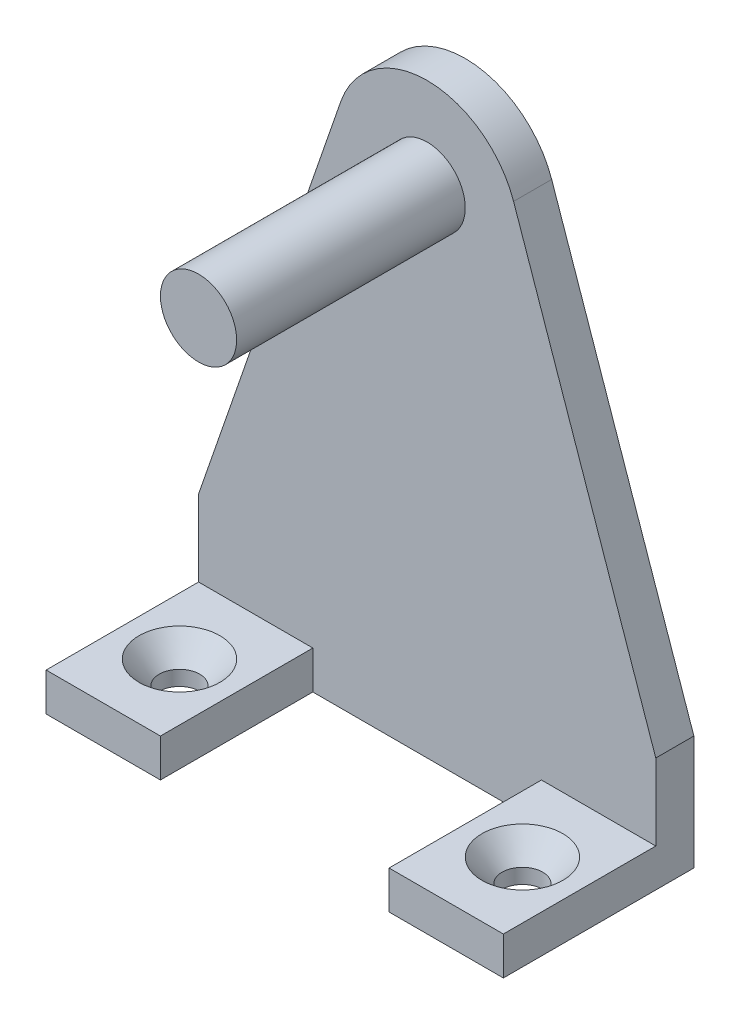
ISO-10303-21;
HEADER;
FILE_DESCRIPTION(('STEP AP214'),'2;1');
FILE_NAME('part.step','',(''),(''),'','','');
FILE_SCHEMA(('AUTOMOTIVE_DESIGN { 1 0 10303 214 1 1 1 1 }'));
ENDSEC;
DATA;
#1=APPLICATION_CONTEXT('core data for automotive mechanical design processes');
#2=APPLICATION_PROTOCOL_DEFINITION('international standard','automotive_design',2000,#1);
#3=PRODUCT_CONTEXT('',#1,'mechanical');
#4=PRODUCT('Part','Part','',(#3));
#5=PRODUCT_RELATED_PRODUCT_CATEGORY('part','',(#4));
#6=PRODUCT_DEFINITION_FORMATION('','',#4);
#7=PRODUCT_DEFINITION_CONTEXT('part definition',#1,'design');
#8=PRODUCT_DEFINITION('design','',#6,#7);
#9=PRODUCT_DEFINITION_SHAPE('','',#8);
#10=(LENGTH_UNIT() NAMED_UNIT(*) SI_UNIT(.MILLI.,.METRE.));
#11=(NAMED_UNIT(*) PLANE_ANGLE_UNIT() SI_UNIT($,.RADIAN.));
#12=(NAMED_UNIT(*) SI_UNIT($,.STERADIAN.) SOLID_ANGLE_UNIT());
#13=UNCERTAINTY_MEASURE_WITH_UNIT(LENGTH_MEASURE(1.E-05),#10,'distance_accuracy_value','');
#14=(GEOMETRIC_REPRESENTATION_CONTEXT(3) GLOBAL_UNCERTAINTY_ASSIGNED_CONTEXT((#13)) GLOBAL_UNIT_ASSIGNED_CONTEXT((#10,
#11,#12)) REPRESENTATION_CONTEXT('',''));
#15=CARTESIAN_POINT('',(0.,0.,0.));
#16=DIRECTION('',(0.,0.,1.));
#17=DIRECTION('',(1.,0.,0.));
#18=AXIS2_PLACEMENT_3D('',#15,#16,#17);
#19=CARTESIAN_POINT('',(-38.1,6.35,25.4));
#20=DIRECTION('',(0.,-1.,0.));
#21=DIRECTION('',(1.,0.,0.));
#22=AXIS2_PLACEMENT_3D('',#19,#20,#21);
#23=PLANE('',#22);
#24=DIRECTION('',(-1.,0.,0.));
#25=VECTOR('',#24,1.);
#26=CARTESIAN_POINT('',(-38.1,6.35,0.));
#27=LINE('',#26,#25);
#28=CARTESIAN_POINT('',(-19.05,6.34999999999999,0.));
#29=VERTEX_POINT('',#28);
#30=CARTESIAN_POINT('',(-38.1,6.34999999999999,0.));
#31=VERTEX_POINT('',#30);
#32=EDGE_CURVE('E183',#29,#31,#27,.T.);
#33=ORIENTED_EDGE('',*,*,#32,.T.);
#34=DIRECTION('',(0.,0.,-1.));
#35=VECTOR('',#34,1.);
#36=CARTESIAN_POINT('',(-38.1,6.35,25.4));
#37=LINE('',#36,#35);
#38=CARTESIAN_POINT('',(-38.1,6.35,25.4));
#39=VERTEX_POINT('',#38);
#40=EDGE_CURVE('E73',#39,#31,#37,.T.);
#41=ORIENTED_EDGE('',*,*,#40,.F.);
#42=DIRECTION('',(-1.,0.,0.));
#43=VECTOR('',#42,1.);
#44=CARTESIAN_POINT('',(-38.1,6.35,25.4));
#45=LINE('',#44,#43);
#46=CARTESIAN_POINT('',(-19.05,6.34999999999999,25.4));
#47=VERTEX_POINT('',#46);
#48=EDGE_CURVE('E187',#47,#39,#45,.T.);
#49=ORIENTED_EDGE('',*,*,#48,.F.);
#50=DIRECTION('',(0.,0.,-1.));
#51=VECTOR('',#50,1.);
#52=CARTESIAN_POINT('',(-19.05,6.34999999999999,25.4));
#53=LINE('',#52,#51);
#54=EDGE_CURVE('E192',#47,#29,#53,.T.);
#55=ORIENTED_EDGE('',*,*,#54,.T.);
#56=EDGE_LOOP('',(#33,#41,#49,#55));
#57=FACE_BOUND('',#56,.T.);
#58=CARTESIAN_POINT('',(-28.575,6.34999999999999,12.7));
#59=DIRECTION('',(0.,1.,0.));
#60=DIRECTION('',(0.,0.,1.));
#61=AXIS2_PLACEMENT_3D('',#58,#59,#60);
#62=CIRCLE('',#61,6.7437);
#63=CARTESIAN_POINT('',(-28.575,6.34999999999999,19.4437));
#64=VERTEX_POINT('',#63);
#65=EDGE_CURVE('E320',#64,#64,#62,.T.);
#66=ORIENTED_EDGE('',*,*,#65,.F.);
#67=EDGE_LOOP('',(#66));
#68=FACE_BOUND('',#67,.T.);
#69=ADVANCED_FACE('F48',(#57,#68),#23,.F.);
#70=CARTESIAN_POINT('',(38.1,6.35000000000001,25.4));
#71=DIRECTION('',(0.,-1.,0.));
#72=DIRECTION('',(1.,0.,0.));
#73=AXIS2_PLACEMENT_3D('',#70,#71,#72);
#74=PLANE('',#73);
#75=DIRECTION('',(-1.,0.,0.));
#76=VECTOR('',#75,1.);
#77=CARTESIAN_POINT('',(38.1,6.35000000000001,0.));
#78=LINE('',#77,#76);
#79=CARTESIAN_POINT('',(38.1,6.35000000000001,0.));
#80=VERTEX_POINT('',#79);
#81=CARTESIAN_POINT('',(19.05,6.35,0.));
#82=VERTEX_POINT('',#81);
#83=EDGE_CURVE('E164',#80,#82,#78,.T.);
#84=ORIENTED_EDGE('',*,*,#83,.T.);
#85=DIRECTION('',(0.,0.,-1.));
#86=VECTOR('',#85,1.);
#87=CARTESIAN_POINT('',(19.05,6.35,25.4));
#88=LINE('',#87,#86);
#89=CARTESIAN_POINT('',(19.05,6.35,25.4));
#90=VERTEX_POINT('',#89);
#91=EDGE_CURVE('E174',#90,#82,#88,.T.);
#92=ORIENTED_EDGE('',*,*,#91,.F.);
#93=DIRECTION('',(-1.,0.,0.));
#94=VECTOR('',#93,1.);
#95=CARTESIAN_POINT('',(38.1,6.35000000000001,25.4));
#96=LINE('',#95,#94);
#97=CARTESIAN_POINT('',(38.1,6.35000000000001,25.4));
#98=VERTEX_POINT('',#97);
#99=EDGE_CURVE('E157',#98,#90,#96,.T.);
#100=ORIENTED_EDGE('',*,*,#99,.F.);
#101=DIRECTION('',(0.,0.,-1.));
#102=VECTOR('',#101,1.);
#103=CARTESIAN_POINT('',(38.1,6.35000000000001,25.4));
#104=LINE('',#103,#102);
#105=EDGE_CURVE('E154',#98,#80,#104,.T.);
#106=ORIENTED_EDGE('',*,*,#105,.T.);
#107=EDGE_LOOP('',(#84,#92,#100,#106));
#108=FACE_BOUND('',#107,.T.);
#109=CARTESIAN_POINT('',(28.575,6.34999999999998,12.7));
#110=DIRECTION('',(0.,1.,0.));
#111=DIRECTION('',(0.,0.,1.));
#112=AXIS2_PLACEMENT_3D('',#109,#110,#111);
#113=CIRCLE('',#112,6.7437);
#114=CARTESIAN_POINT('',(28.575,6.34999999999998,19.4437));
#115=VERTEX_POINT('',#114);
#116=EDGE_CURVE('E310',#115,#115,#113,.T.);
#117=ORIENTED_EDGE('',*,*,#116,.F.);
#118=EDGE_LOOP('',(#117));
#119=FACE_BOUND('',#118,.T.);
#120=ADVANCED_FACE('F267',(#108,#119),#74,.F.);
#121=CARTESIAN_POINT('',(0.,-48.3537648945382,0.));
#122=DIRECTION('',(0.,0.,1.));
#123=DIRECTION('',(1.,0.,0.));
#124=AXIS2_PLACEMENT_3D('',#121,#122,#123);
#125=PLANE('',#124);
#126=CARTESIAN_POINT('',(0.,82.55,0.));
#127=DIRECTION('',(0.,0.,1.));
#128=DIRECTION('',(1.,0.,0.));
#129=AXIS2_PLACEMENT_3D('',#126,#127,#128);
#130=CIRCLE('',#129,6.35);
#131=CARTESIAN_POINT('',(-6.35,82.55,0.));
#132=VERTEX_POINT('',#131);
#133=EDGE_CURVE('E198',#132,#132,#130,.T.);
#134=ORIENTED_EDGE('',*,*,#133,.F.);
#135=EDGE_LOOP('',(#134));
#136=FACE_BOUND('',#135,.T.);
#137=DIRECTION('',(0.,-1.,0.));
#138=VECTOR('',#137,1.);
#139=CARTESIAN_POINT('',(19.05,0.,0.));
#140=LINE('',#139,#138);
#141=CARTESIAN_POINT('',(19.05,0.,0.));
#142=VERTEX_POINT('',#141);
#143=EDGE_CURVE('E162',#82,#142,#140,.T.);
#144=ORIENTED_EDGE('',*,*,#143,.F.);
#145=ORIENTED_EDGE('',*,*,#83,.F.);
#146=DIRECTION('',(0.,1.,0.));
#147=VECTOR('',#146,1.);
#148=CARTESIAN_POINT('',(38.1,-48.3537648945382,0.));
#149=LINE('',#148,#147);
#150=CARTESIAN_POINT('',(38.1,19.05,0.));
#151=VERTEX_POINT('',#150);
#152=EDGE_CURVE('E226',#80,#151,#149,.T.);
#153=ORIENTED_EDGE('',*,*,#152,.T.);
#154=DIRECTION('',(-0.327012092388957,0.945020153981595,0.));
#155=VECTOR('',#154,1.);
#156=CARTESIAN_POINT('',(54.8556926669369,-29.3716566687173,0.));
#157=LINE('',#156,#155);
#158=CARTESIAN_POINT('',(14.4021071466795,87.5336642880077,0.));
#159=VERTEX_POINT('',#158);
#160=EDGE_CURVE('E208',#151,#159,#157,.T.);
#161=ORIENTED_EDGE('',*,*,#160,.T.);
#162=CARTESIAN_POINT('',(0.,82.55,0.));
#163=DIRECTION('',(0.,0.,1.));
#164=DIRECTION('',(1.,0.,0.));
#165=AXIS2_PLACEMENT_3D('',#162,#163,#164);
#166=CIRCLE('',#165,15.24);
#167=CARTESIAN_POINT('',(-14.4021071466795,87.5336642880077,0.));
#168=VERTEX_POINT('',#167);
#169=EDGE_CURVE('E202',#168,#159,#166,.F.);
#170=ORIENTED_EDGE('',*,*,#169,.F.);
#171=DIRECTION('',(0.327012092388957,0.945020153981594,0.));
#172=VECTOR('',#171,1.);
#173=CARTESIAN_POINT('',(-54.8556926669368,-29.3716566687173,0.));
#174=LINE('',#173,#172);
#175=CARTESIAN_POINT('',(-38.1,19.05,0.));
#176=VERTEX_POINT('',#175);
#177=EDGE_CURVE('E220',#176,#168,#174,.T.);
#178=ORIENTED_EDGE('',*,*,#177,.F.);
#179=DIRECTION('',(0.,1.,0.));
#180=VECTOR('',#179,1.);
#181=CARTESIAN_POINT('',(-38.1,-48.3537648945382,0.));
#182=LINE('',#181,#180);
#183=EDGE_CURVE('E222',#31,#176,#182,.T.);
#184=ORIENTED_EDGE('',*,*,#183,.F.);
#185=ORIENTED_EDGE('',*,*,#32,.F.);
#186=DIRECTION('',(0.,1.,0.));
#187=VECTOR('',#186,1.);
#188=CARTESIAN_POINT('',(-19.05,0.,0.));
#189=LINE('',#188,#187);
#190=CARTESIAN_POINT('',(-19.05,0.,0.));
#191=VERTEX_POINT('',#190);
#192=EDGE_CURVE('E178',#191,#29,#189,.T.);
#193=ORIENTED_EDGE('',*,*,#192,.F.);
#194=DIRECTION('',(-1.,0.,0.));
#195=VECTOR('',#194,1.);
#196=CARTESIAN_POINT('',(0.,0.,0.));
#197=LINE('',#196,#195);
#198=EDGE_CURVE('E224',#142,#191,#197,.T.);
#199=ORIENTED_EDGE('',*,*,#198,.F.);
#200=EDGE_LOOP('',(#144,#145,#153,#161,#170,#178,#184,#185,#193,#199));
#201=FACE_BOUND('',#200,.T.);
#202=ADVANCED_FACE('F246',(#136,#201),#125,.T.);
#203=CARTESIAN_POINT('',(0.,82.55,-6.35));
#204=DIRECTION('',(0.,0.,1.));
#205=DIRECTION('',(1.,0.,0.));
#206=AXIS2_PLACEMENT_3D('',#203,#204,#205);
#207=CYLINDRICAL_SURFACE('',#206,15.24);
#208=ORIENTED_EDGE('',*,*,#169,.T.);
#209=DIRECTION('',(0.,0.,1.));
#210=VECTOR('',#209,1.);
#211=CARTESIAN_POINT('',(14.4021071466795,87.5336642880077,-6.35));
#212=LINE('',#211,#210);
#213=CARTESIAN_POINT('',(14.4021071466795,87.5336642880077,-6.35));
#214=VERTEX_POINT('',#213);
#215=EDGE_CURVE('E12',#214,#159,#212,.T.);
#216=ORIENTED_EDGE('',*,*,#215,.F.);
#217=CARTESIAN_POINT('',(0.,82.55,-6.35));
#218=DIRECTION('',(0.,0.,1.));
#219=DIRECTION('',(1.,0.,0.));
#220=AXIS2_PLACEMENT_3D('',#217,#218,#219);
#221=CIRCLE('',#220,15.24);
#222=CARTESIAN_POINT('',(-14.4021071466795,87.5336642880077,-6.35));
#223=VERTEX_POINT('',#222);
#224=EDGE_CURVE('E205',#223,#214,#221,.F.);
#225=ORIENTED_EDGE('',*,*,#224,.F.);
#226=DIRECTION('',(0.,0.,1.));
#227=VECTOR('',#226,1.);
#228=CARTESIAN_POINT('',(-14.4021071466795,87.5336642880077,-6.35));
#229=LINE('',#228,#227);
#230=EDGE_CURVE('E52',#223,#168,#229,.T.);
#231=ORIENTED_EDGE('',*,*,#230,.T.);
#232=EDGE_LOOP('',(#208,#216,#225,#231));
#233=FACE_BOUND('',#232,.T.);
#234=ADVANCED_FACE('F50',(#233),#207,.T.);
#235=CARTESIAN_POINT('',(54.8556926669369,-29.3716566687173,-6.35));
#236=DIRECTION('',(0.945020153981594,0.327012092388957,0.));
#237=DIRECTION('',(-0.327012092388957,0.945020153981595,0.));
#238=AXIS2_PLACEMENT_3D('',#235,#236,#237);
#239=PLANE('',#238);
#240=ORIENTED_EDGE('',*,*,#160,.F.);
#241=DIRECTION('',(0.,0.,1.));
#242=VECTOR('',#241,1.);
#243=CARTESIAN_POINT('',(38.1,19.05,-6.35));
#244=LINE('',#243,#242);
#245=CARTESIAN_POINT('',(38.1,19.05,-6.35));
#246=VERTEX_POINT('',#245);
#247=EDGE_CURVE('E57',#246,#151,#244,.T.);
#248=ORIENTED_EDGE('',*,*,#247,.F.);
#249=DIRECTION('',(-0.327012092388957,0.945020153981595,0.));
#250=VECTOR('',#249,1.);
#251=CARTESIAN_POINT('',(54.8556926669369,-29.3716566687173,-6.35));
#252=LINE('',#251,#250);
#253=EDGE_CURVE('E215',#246,#214,#252,.T.);
#254=ORIENTED_EDGE('',*,*,#253,.T.);
#255=ORIENTED_EDGE('',*,*,#215,.T.);
#256=EDGE_LOOP('',(#240,#248,#254,#255));
#257=FACE_BOUND('',#256,.T.);
#258=ADVANCED_FACE('F251',(#257),#239,.T.);
#259=CARTESIAN_POINT('',(38.1,-48.3537648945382,-6.35));
#260=DIRECTION('',(1.,0.,0.));
#261=DIRECTION('',(0.,0.,-1.));
#262=AXIS2_PLACEMENT_3D('',#259,#260,#261);
#263=PLANE('',#262);
#264=ORIENTED_EDGE('',*,*,#152,.F.);
#265=ORIENTED_EDGE('',*,*,#105,.F.);
#266=DIRECTION('',(0.,1.,0.));
#267=VECTOR('',#266,1.);
#268=CARTESIAN_POINT('',(38.1,0.,25.4));
#269=LINE('',#268,#267);
#270=CARTESIAN_POINT('',(38.1,0.,25.4));
#271=VERTEX_POINT('',#270);
#272=EDGE_CURVE('E151',#271,#98,#269,.T.);
#273=ORIENTED_EDGE('',*,*,#272,.F.);
#274=DIRECTION('',(0.,0.,1.));
#275=VECTOR('',#274,1.);
#276=CARTESIAN_POINT('',(38.1,0.,-6.35));
#277=LINE('',#276,#275);
#278=CARTESIAN_POINT('',(38.1,0.,-6.35));
#279=VERTEX_POINT('',#278);
#280=EDGE_CURVE('E138',#279,#271,#277,.T.);
#281=ORIENTED_EDGE('',*,*,#280,.F.);
#282=DIRECTION('',(0.,1.,0.));
#283=VECTOR('',#282,1.);
#284=CARTESIAN_POINT('',(38.1,-48.3537648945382,-6.35));
#285=LINE('',#284,#283);
#286=EDGE_CURVE('E213',#279,#246,#285,.T.);
#287=ORIENTED_EDGE('',*,*,#286,.T.);
#288=ORIENTED_EDGE('',*,*,#247,.T.);
#289=EDGE_LOOP('',(#264,#265,#273,#281,#287,#288));
#290=FACE_BOUND('',#289,.T.);
#291=ADVANCED_FACE('F153',(#290),#263,.T.);
#292=CARTESIAN_POINT('',(0.,0.,-6.35));
#293=DIRECTION('',(0.,1.,0.));
#294=DIRECTION('',(-1.,0.,0.));
#295=AXIS2_PLACEMENT_3D('',#292,#293,#294);
#296=PLANE('',#295);
#297=CARTESIAN_POINT('',(-28.575,0.,12.7));
#298=DIRECTION('',(0.,1.,0.));
#299=DIRECTION('',(0.,0.,1.));
#300=AXIS2_PLACEMENT_3D('',#297,#298,#299);
#301=CIRCLE('',#300,3.3782);
#302=CARTESIAN_POINT('',(-28.575,0.,16.0782));
#303=VERTEX_POINT('',#302);
#304=EDGE_CURVE('E304',#303,#303,#301,.T.);
#305=ORIENTED_EDGE('',*,*,#304,.T.);
#306=EDGE_LOOP('',(#305));
#307=FACE_BOUND('',#306,.T.);
#308=CARTESIAN_POINT('',(28.575,0.,12.7));
#309=DIRECTION('',(0.,1.,0.));
#310=DIRECTION('',(0.,0.,1.));
#311=AXIS2_PLACEMENT_3D('',#308,#309,#310);
#312=CIRCLE('',#311,3.3782);
#313=CARTESIAN_POINT('',(28.575,0.,16.0782));
#314=VERTEX_POINT('',#313);
#315=EDGE_CURVE('E167',#314,#314,#312,.T.);
#316=ORIENTED_EDGE('',*,*,#315,.T.);
#317=EDGE_LOOP('',(#316));
#318=FACE_BOUND('',#317,.T.);
#319=ORIENTED_EDGE('',*,*,#280,.T.);
#320=DIRECTION('',(1.,0.,0.));
#321=VECTOR('',#320,1.);
#322=CARTESIAN_POINT('',(38.1,0.,25.4));
#323=LINE('',#322,#321);
#324=CARTESIAN_POINT('',(19.05,0.,25.4));
#325=VERTEX_POINT('',#324);
#326=EDGE_CURVE('E142',#325,#271,#323,.T.);
#327=ORIENTED_EDGE('',*,*,#326,.F.);
#328=DIRECTION('',(0.,0.,-1.));
#329=VECTOR('',#328,1.);
#330=CARTESIAN_POINT('',(19.05,0.,25.4));
#331=LINE('',#330,#329);
#332=EDGE_CURVE('E65',#325,#142,#331,.T.);
#333=ORIENTED_EDGE('',*,*,#332,.T.);
#334=ORIENTED_EDGE('',*,*,#198,.T.);
#335=DIRECTION('',(0.,0.,-1.));
#336=VECTOR('',#335,1.);
#337=CARTESIAN_POINT('',(-19.05,0.,25.4));
#338=LINE('',#337,#336);
#339=CARTESIAN_POINT('',(-19.05,0.,25.4));
#340=VERTEX_POINT('',#339);
#341=EDGE_CURVE('E195',#340,#191,#338,.T.);
#342=ORIENTED_EDGE('',*,*,#341,.F.);
#343=DIRECTION('',(1.,0.,0.));
#344=VECTOR('',#343,1.);
#345=CARTESIAN_POINT('',(-38.1,0.,25.4));
#346=LINE('',#345,#344);
#347=CARTESIAN_POINT('',(-38.1,0.,25.4));
#348=VERTEX_POINT('',#347);
#349=EDGE_CURVE('E182',#348,#340,#346,.T.);
#350=ORIENTED_EDGE('',*,*,#349,.F.);
#351=DIRECTION('',(0.,0.,1.));
#352=VECTOR('',#351,1.);
#353=CARTESIAN_POINT('',(-38.1,0.,-6.35));
#354=LINE('',#353,#352);
#355=CARTESIAN_POINT('',(-38.1,0.,-6.35));
#356=VERTEX_POINT('',#355);
#357=EDGE_CURVE('E148',#356,#348,#354,.T.);
#358=ORIENTED_EDGE('',*,*,#357,.F.);
#359=DIRECTION('',(-1.,0.,0.));
#360=VECTOR('',#359,1.);
#361=CARTESIAN_POINT('',(0.,0.,-6.35));
#362=LINE('',#361,#360);
#363=EDGE_CURVE('E144',#279,#356,#362,.T.);
#364=ORIENTED_EDGE('',*,*,#363,.F.);
#365=EDGE_LOOP('',(#319,#327,#333,#334,#342,#350,#358,#364));
#366=FACE_BOUND('',#365,.T.);
#367=ADVANCED_FACE('F140',(#307,#318,#366),#296,.F.);
#368=CARTESIAN_POINT('',(-38.1,-48.3537648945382,-6.35));
#369=DIRECTION('',(1.,0.,0.));
#370=DIRECTION('',(0.,0.,-1.));
#371=AXIS2_PLACEMENT_3D('',#368,#369,#370);
#372=PLANE('',#371);
#373=ORIENTED_EDGE('',*,*,#357,.T.);
#374=DIRECTION('',(0.,-1.,0.));
#375=VECTOR('',#374,1.);
#376=CARTESIAN_POINT('',(-38.1,0.,25.4));
#377=LINE('',#376,#375);
#378=EDGE_CURVE('E179',#39,#348,#377,.T.);
#379=ORIENTED_EDGE('',*,*,#378,.F.);
#380=ORIENTED_EDGE('',*,*,#40,.T.);
#381=ORIENTED_EDGE('',*,*,#183,.T.);
#382=DIRECTION('',(0.,0.,1.));
#383=VECTOR('',#382,1.);
#384=CARTESIAN_POINT('',(-38.1,19.05,-6.35));
#385=LINE('',#384,#383);
#386=CARTESIAN_POINT('',(-38.1,19.05,-6.35));
#387=VERTEX_POINT('',#386);
#388=EDGE_CURVE('E232',#387,#176,#385,.T.);
#389=ORIENTED_EDGE('',*,*,#388,.F.);
#390=DIRECTION('',(0.,1.,0.));
#391=VECTOR('',#390,1.);
#392=CARTESIAN_POINT('',(-38.1,-48.3537648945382,-6.35));
#393=LINE('',#392,#391);
#394=EDGE_CURVE('E210',#356,#387,#393,.T.);
#395=ORIENTED_EDGE('',*,*,#394,.F.);
#396=EDGE_LOOP('',(#373,#379,#380,#381,#389,#395));
#397=FACE_BOUND('',#396,.T.);
#398=ADVANCED_FACE('F258',(#397),#372,.F.);
#399=CARTESIAN_POINT('',(-54.8556926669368,-29.3716566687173,-6.35));
#400=DIRECTION('',(0.945020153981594,-0.327012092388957,0.));
#401=DIRECTION('',(0.327012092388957,0.945020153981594,0.));
#402=AXIS2_PLACEMENT_3D('',#399,#400,#401);
#403=PLANE('',#402);
#404=ORIENTED_EDGE('',*,*,#177,.T.);
#405=ORIENTED_EDGE('',*,*,#230,.F.);
#406=DIRECTION('',(0.327012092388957,0.945020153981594,0.));
#407=VECTOR('',#406,1.);
#408=CARTESIAN_POINT('',(-54.8556926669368,-29.3716566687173,-6.35));
#409=LINE('',#408,#407);
#410=EDGE_CURVE('E207',#387,#223,#409,.T.);
#411=ORIENTED_EDGE('',*,*,#410,.F.);
#412=ORIENTED_EDGE('',*,*,#388,.T.);
#413=EDGE_LOOP('',(#404,#405,#411,#412));
#414=FACE_BOUND('',#413,.T.);
#415=ADVANCED_FACE('F256',(#414),#403,.F.);
#416=CARTESIAN_POINT('',(0.,-48.3537648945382,-6.35));
#417=DIRECTION('',(0.,0.,1.));
#418=DIRECTION('',(1.,0.,0.));
#419=AXIS2_PLACEMENT_3D('',#416,#417,#418);
#420=PLANE('',#419);
#421=ORIENTED_EDGE('',*,*,#224,.T.);
#422=ORIENTED_EDGE('',*,*,#253,.F.);
#423=ORIENTED_EDGE('',*,*,#286,.F.);
#424=ORIENTED_EDGE('',*,*,#363,.T.);
#425=ORIENTED_EDGE('',*,*,#394,.T.);
#426=ORIENTED_EDGE('',*,*,#410,.T.);
#427=EDGE_LOOP('',(#421,#422,#423,#424,#425,#426));
#428=FACE_BOUND('',#427,.T.);
#429=ADVANCED_FACE('F254',(#428),#420,.F.);
#430=CARTESIAN_POINT('',(0.,82.55,38.1));
#431=DIRECTION('',(0.,0.,-1.));
#432=DIRECTION('',(-1.,0.,0.));
#433=AXIS2_PLACEMENT_3D('',#430,#431,#432);
#434=CYLINDRICAL_SURFACE('',#433,6.35);
#435=CARTESIAN_POINT('',(0.,82.55,38.1));
#436=DIRECTION('',(0.,0.,1.));
#437=DIRECTION('',(1.,0.,0.));
#438=AXIS2_PLACEMENT_3D('',#435,#436,#437);
#439=CIRCLE('',#438,6.35);
#440=CARTESIAN_POINT('',(-6.35,82.55,38.1));
#441=VERTEX_POINT('',#440);
#442=EDGE_CURVE('E199',#441,#441,#439,.T.);
#443=CARTESIAN_POINT('',(-6.35,82.55,0.));
#444=CARTESIAN_POINT('',(-6.35,82.55,0.396875));
#445=CARTESIAN_POINT('',(-6.35,82.55,0.79375));
#446=CARTESIAN_POINT('',(-6.35,82.55,1.5875));
#447=CARTESIAN_POINT('',(-6.35,82.55,1.984375));
#448=CARTESIAN_POINT('',(-6.35,82.55,2.778125));
#449=CARTESIAN_POINT('',(-6.35,82.55,3.175));
#450=CARTESIAN_POINT('',(-6.35,82.55,3.96875));
#451=CARTESIAN_POINT('',(-6.35,82.55,4.365625));
#452=CARTESIAN_POINT('',(-6.35,82.55,5.159375));
#453=CARTESIAN_POINT('',(-6.35,82.55,5.55625));
#454=CARTESIAN_POINT('',(-6.35,82.55,6.35));
#455=CARTESIAN_POINT('',(-6.35,82.55,6.746875));
#456=CARTESIAN_POINT('',(-6.35,82.55,7.540625));
#457=CARTESIAN_POINT('',(-6.35,82.55,7.93749999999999));
#458=CARTESIAN_POINT('',(-6.35,82.55,8.73124999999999));
#459=CARTESIAN_POINT('',(-6.35,82.55,9.128125));
#460=CARTESIAN_POINT('',(-6.35,82.55,9.92187499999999));
#461=CARTESIAN_POINT('',(-6.35,82.55,10.31875));
#462=CARTESIAN_POINT('',(-6.35,82.55,11.1125));
#463=CARTESIAN_POINT('',(-6.35,82.55,11.509375));
#464=CARTESIAN_POINT('',(-6.35,82.55,12.303125));
#465=CARTESIAN_POINT('',(-6.35,82.55,12.7));
#466=CARTESIAN_POINT('',(-6.35,82.55,13.49375));
#467=CARTESIAN_POINT('',(-6.35,82.55,13.890625));
#468=CARTESIAN_POINT('',(-6.35,82.55,14.684375));
#469=CARTESIAN_POINT('',(-6.35,82.55,15.08125));
#470=CARTESIAN_POINT('',(-6.35,82.55,15.875));
#471=CARTESIAN_POINT('',(-6.35,82.55,16.271875));
#472=CARTESIAN_POINT('',(-6.35,82.55,17.065625));
#473=CARTESIAN_POINT('',(-6.35,82.55,17.4625));
#474=CARTESIAN_POINT('',(-6.35,82.55,18.25625));
#475=CARTESIAN_POINT('',(-6.35,82.55,18.653125));
#476=CARTESIAN_POINT('',(-6.35,82.55,19.446875));
#477=CARTESIAN_POINT('',(-6.35,82.55,19.84375));
#478=CARTESIAN_POINT('',(-6.35,82.55,20.6375));
#479=CARTESIAN_POINT('',(-6.35,82.55,21.034375));
#480=CARTESIAN_POINT('',(-6.35,82.55,21.828125));
#481=CARTESIAN_POINT('',(-6.35,82.55,22.225));
#482=CARTESIAN_POINT('',(-6.35,82.55,23.01875));
#483=CARTESIAN_POINT('',(-6.35,82.55,23.415625));
#484=CARTESIAN_POINT('',(-6.35,82.55,24.209375));
#485=CARTESIAN_POINT('',(-6.35,82.55,24.60625));
#486=CARTESIAN_POINT('',(-6.35,82.55,25.4));
#487=CARTESIAN_POINT('',(-6.35,82.55,25.796875));
#488=CARTESIAN_POINT('',(-6.35,82.55,26.590625));
#489=CARTESIAN_POINT('',(-6.35,82.55,26.9875));
#490=CARTESIAN_POINT('',(-6.35,82.55,27.78125));
#491=CARTESIAN_POINT('',(-6.35,82.55,28.178125));
#492=CARTESIAN_POINT('',(-6.35,82.55,28.971875));
#493=CARTESIAN_POINT('',(-6.35,82.55,29.36875));
#494=CARTESIAN_POINT('',(-6.35,82.55,30.1625));
#495=CARTESIAN_POINT('',(-6.35,82.55,30.559375));
#496=CARTESIAN_POINT('',(-6.35,82.55,31.353125));
#497=CARTESIAN_POINT('',(-6.35,82.55,31.75));
#498=CARTESIAN_POINT('',(-6.35,82.55,32.54375));
#499=CARTESIAN_POINT('',(-6.35,82.55,32.940625));
#500=CARTESIAN_POINT('',(-6.35,82.55,33.734375));
#501=CARTESIAN_POINT('',(-6.35,82.55,34.13125));
#502=CARTESIAN_POINT('',(-6.35,82.55,34.925));
#503=CARTESIAN_POINT('',(-6.35,82.55,35.321875));
#504=CARTESIAN_POINT('',(-6.35,82.55,36.115625));
#505=CARTESIAN_POINT('',(-6.35,82.55,36.5125));
#506=CARTESIAN_POINT('',(-6.35,82.55,37.30625));
#507=CARTESIAN_POINT('',(-6.35,82.55,37.703125));
#508=CARTESIAN_POINT('',(-6.35,82.55,38.1));
#509=B_SPLINE_CURVE_WITH_KNOTS('',3,(#443,#444,#445,#446,#447,#448,#449,#450,#451,#452,#453,
#454,#455,#456,#457,#458,#459,#460,#461,#462,#463,#464,#465,#466,#467,#468,#469,#470,#471,#472,
#473,#474,#475,#476,#477,#478,#479,#480,#481,#482,#483,#484,#485,#486,#487,#488,#489,#490,#491,
#492,#493,#494,#495,#496,#497,#498,#499,#500,#501,#502,#503,#504,#505,#506,#507,#508),
.UNSPECIFIED.,.F.,.F.,(4,2,2,2,2,2,2,2,2,2,2,2,2,2,2,2,2,2,2,2,2,2,2,2,2,2,2,2,2,2,2,2,4),(0.,
1.190625,2.38125,3.571875,4.7625,5.953125,7.14375,8.33437499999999,9.525,10.715625,11.90625,
13.096875,14.2875,15.478125,16.66875,17.859375,19.05,20.240625,21.43125,22.621875,23.8125,
25.003125,26.19375,27.384375,28.575,29.765625,30.95625,32.146875,33.3375,34.528125,35.71875,
36.909375,38.1),.UNSPECIFIED.);
#510=EDGE_CURVE('BSEAM263',#132,#441,#509,.T.);
#511=ORIENTED_EDGE('',*,*,#133,.T.);
#512=ORIENTED_EDGE('',*,*,#442,.F.);
#513=ORIENTED_EDGE('',*,*,#510,.T.);
#514=ORIENTED_EDGE('',*,*,#510,.F.);
#515=EDGE_LOOP('',(#511,#513,#512,#514));
#516=FACE_BOUND('',#515,.T.);
#517=ADVANCED_FACE('F263',(#516),#434,.T.);
#518=CARTESIAN_POINT('',(0.,-48.3537648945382,38.1));
#519=DIRECTION('',(0.,0.,1.));
#520=DIRECTION('',(1.,0.,0.));
#521=AXIS2_PLACEMENT_3D('',#518,#519,#520);
#522=PLANE('',#521);
#523=ORIENTED_EDGE('',*,*,#442,.T.);
#524=EDGE_LOOP('',(#523));
#525=FACE_BOUND('',#524,.T.);
#526=ADVANCED_FACE('F282',(#525),#522,.T.);
#527=CARTESIAN_POINT('',(-19.05,0.,25.4));
#528=DIRECTION('',(-1.,0.,0.));
#529=DIRECTION('',(0.,0.,1.));
#530=AXIS2_PLACEMENT_3D('',#527,#528,#529);
#531=PLANE('',#530);
#532=ORIENTED_EDGE('',*,*,#192,.T.);
#533=ORIENTED_EDGE('',*,*,#54,.F.);
#534=DIRECTION('',(0.,1.,0.));
#535=VECTOR('',#534,1.);
#536=CARTESIAN_POINT('',(-19.05,0.,25.4));
#537=LINE('',#536,#535);
#538=EDGE_CURVE('E185',#340,#47,#537,.T.);
#539=ORIENTED_EDGE('',*,*,#538,.F.);
#540=ORIENTED_EDGE('',*,*,#341,.T.);
#541=EDGE_LOOP('',(#532,#533,#539,#540));
#542=FACE_BOUND('',#541,.T.);
#543=ADVANCED_FACE('F279',(#542),#531,.F.);
#544=CARTESIAN_POINT('',(-38.1,6.35,25.4));
#545=DIRECTION('',(0.,0.,-1.));
#546=DIRECTION('',(-1.,0.,0.));
#547=AXIS2_PLACEMENT_3D('',#544,#545,#546);
#548=PLANE('',#547);
#549=ORIENTED_EDGE('',*,*,#378,.T.);
#550=ORIENTED_EDGE('',*,*,#349,.T.);
#551=ORIENTED_EDGE('',*,*,#538,.T.);
#552=ORIENTED_EDGE('',*,*,#48,.T.);
#553=EDGE_LOOP('',(#549,#550,#551,#552));
#554=FACE_BOUND('',#553,.T.);
#555=ADVANCED_FACE('F278',(#554),#548,.F.);
#556=CARTESIAN_POINT('',(19.05,0.,25.4));
#557=DIRECTION('',(1.,0.,0.));
#558=DIRECTION('',(0.,0.,-1.));
#559=AXIS2_PLACEMENT_3D('',#556,#557,#558);
#560=PLANE('',#559);
#561=ORIENTED_EDGE('',*,*,#143,.T.);
#562=ORIENTED_EDGE('',*,*,#332,.F.);
#563=DIRECTION('',(0.,-1.,0.));
#564=VECTOR('',#563,1.);
#565=CARTESIAN_POINT('',(19.05,0.,25.4));
#566=LINE('',#565,#564);
#567=EDGE_CURVE('E161',#90,#325,#566,.T.);
#568=ORIENTED_EDGE('',*,*,#567,.F.);
#569=ORIENTED_EDGE('',*,*,#91,.T.);
#570=EDGE_LOOP('',(#561,#562,#568,#569));
#571=FACE_BOUND('',#570,.T.);
#572=ADVANCED_FACE('F345',(#571),#560,.F.);
#573=CARTESIAN_POINT('',(19.05,0.,25.4));
#574=DIRECTION('',(0.,0.,-1.));
#575=DIRECTION('',(-1.,0.,0.));
#576=AXIS2_PLACEMENT_3D('',#573,#574,#575);
#577=PLANE('',#576);
#578=ORIENTED_EDGE('',*,*,#326,.T.);
#579=ORIENTED_EDGE('',*,*,#272,.T.);
#580=ORIENTED_EDGE('',*,*,#99,.T.);
#581=ORIENTED_EDGE('',*,*,#567,.T.);
#582=EDGE_LOOP('',(#578,#579,#580,#581));
#583=FACE_BOUND('',#582,.T.);
#584=ADVANCED_FACE('F159',(#583),#577,.F.);
#585=CARTESIAN_POINT('',(28.575,6.34999999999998,12.7));
#586=DIRECTION('',(0.,1.,0.));
#587=DIRECTION('',(0.,0.,1.));
#588=AXIS2_PLACEMENT_3D('',#585,#586,#587);
#589=CYLINDRICAL_SURFACE('',#588,3.3782);
#590=ORIENTED_EDGE('',*,*,#315,.F.);
#591=EDGE_LOOP('',(#590));
#592=FACE_BOUND('',#591,.T.);
#593=CARTESIAN_POINT('',(28.575,2.47843512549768,12.7));
#594=DIRECTION('',(0.,1.,0.));
#595=DIRECTION('',(0.,0.,1.));
#596=AXIS2_PLACEMENT_3D('',#593,#594,#595);
#597=CIRCLE('',#596,3.3782);
#598=CARTESIAN_POINT('',(28.575,2.47843512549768,16.0782));
#599=VERTEX_POINT('',#598);
#600=EDGE_CURVE('E308',#599,#599,#597,.T.);
#601=ORIENTED_EDGE('',*,*,#600,.T.);
#602=EDGE_LOOP('',(#601));
#603=FACE_BOUND('',#602,.T.);
#604=ADVANCED_FACE('F339',(#592,#603),#589,.F.);
#605=CARTESIAN_POINT('',(28.575,6.34999999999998,12.7));
#606=DIRECTION('',(0.,1.,0.));
#607=DIRECTION('',(0.,0.,1.));
#608=AXIS2_PLACEMENT_3D('',#605,#606,#607);
#609=CONICAL_SURFACE('',#608,6.7437,0.715584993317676);
#610=ORIENTED_EDGE('',*,*,#600,.F.);
#611=EDGE_LOOP('',(#610));
#612=FACE_BOUND('',#611,.T.);
#613=ORIENTED_EDGE('',*,*,#116,.T.);
#614=EDGE_LOOP('',(#613));
#615=FACE_BOUND('',#614,.T.);
#616=ADVANCED_FACE('F332',(#612,#615),#609,.F.);
#617=CARTESIAN_POINT('',(-28.575,6.34999999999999,12.7));
#618=DIRECTION('',(0.,1.,0.));
#619=DIRECTION('',(0.,0.,1.));
#620=AXIS2_PLACEMENT_3D('',#617,#618,#619);
#621=CYLINDRICAL_SURFACE('',#620,3.3782);
#622=ORIENTED_EDGE('',*,*,#304,.F.);
#623=EDGE_LOOP('',(#622));
#624=FACE_BOUND('',#623,.T.);
#625=CARTESIAN_POINT('',(-28.575,2.47843512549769,12.7));
#626=DIRECTION('',(0.,1.,0.));
#627=DIRECTION('',(0.,0.,1.));
#628=AXIS2_PLACEMENT_3D('',#625,#626,#627);
#629=CIRCLE('',#628,3.3782);
#630=CARTESIAN_POINT('',(-28.575,2.47843512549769,16.0782));
#631=VERTEX_POINT('',#630);
#632=EDGE_CURVE('E317',#631,#631,#629,.T.);
#633=ORIENTED_EDGE('',*,*,#632,.T.);
#634=EDGE_LOOP('',(#633));
#635=FACE_BOUND('',#634,.T.);
#636=ADVANCED_FACE('F326',(#624,#635),#621,.F.);
#637=CARTESIAN_POINT('',(-28.575,6.34999999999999,12.7));
#638=DIRECTION('',(0.,1.,0.));
#639=DIRECTION('',(0.,0.,1.));
#640=AXIS2_PLACEMENT_3D('',#637,#638,#639);
#641=CONICAL_SURFACE('',#640,6.7437,0.715584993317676);
#642=ORIENTED_EDGE('',*,*,#632,.F.);
#643=EDGE_LOOP('',(#642));
#644=FACE_BOUND('',#643,.T.);
#645=ORIENTED_EDGE('',*,*,#65,.T.);
#646=EDGE_LOOP('',(#645));
#647=FACE_BOUND('',#646,.T.);
#648=ADVANCED_FACE('F324',(#644,#647),#641,.F.);
#649=CLOSED_SHELL('',(#69,#120,#202,#234,#258,#291,#367,#398,#415,#429,#517,#526,#543,#555,#572,
#584,#604,#616,#636,#648));
#650=MANIFOLD_SOLID_BREP('B2',#649);
#651=ADVANCED_BREP_SHAPE_REPRESENTATION('',(#18,#650),#14);
#652=SHAPE_DEFINITION_REPRESENTATION(#9,#651);
ENDSEC;
END-ISO-10303-21;
